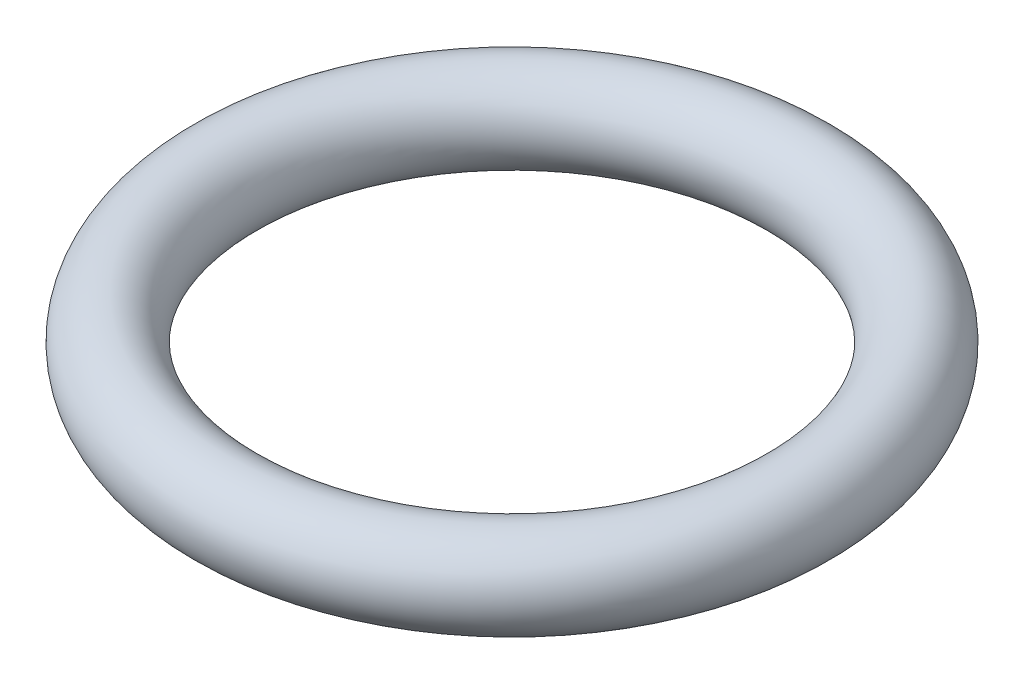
ISO-10303-21;
HEADER;
FILE_DESCRIPTION(('STEP AP214'),'2;1');
FILE_NAME('part.step','',(''),(''),'','','');
FILE_SCHEMA(('AUTOMOTIVE_DESIGN { 1 0 10303 214 1 1 1 1 }'));
ENDSEC;
DATA;
#1=APPLICATION_CONTEXT('core data for automotive mechanical design processes');
#2=APPLICATION_PROTOCOL_DEFINITION('international standard','automotive_design',2000,#1);
#3=PRODUCT_CONTEXT('',#1,'mechanical');
#4=PRODUCT('Part','Part','',(#3));
#5=PRODUCT_RELATED_PRODUCT_CATEGORY('part','',(#4));
#6=PRODUCT_DEFINITION_FORMATION('','',#4);
#7=PRODUCT_DEFINITION_CONTEXT('part definition',#1,'design');
#8=PRODUCT_DEFINITION('design','',#6,#7);
#9=PRODUCT_DEFINITION_SHAPE('','',#8);
#10=(LENGTH_UNIT() NAMED_UNIT(*) SI_UNIT(.MILLI.,.METRE.));
#11=(NAMED_UNIT(*) PLANE_ANGLE_UNIT() SI_UNIT($,.RADIAN.));
#12=(NAMED_UNIT(*) SI_UNIT($,.STERADIAN.) SOLID_ANGLE_UNIT());
#13=UNCERTAINTY_MEASURE_WITH_UNIT(LENGTH_MEASURE(1.E-05),#10,'distance_accuracy_value','');
#14=(GEOMETRIC_REPRESENTATION_CONTEXT(3) GLOBAL_UNCERTAINTY_ASSIGNED_CONTEXT((#13)) GLOBAL_UNIT_ASSIGNED_CONTEXT((#10,
#11,#12)) REPRESENTATION_CONTEXT('',''));
#15=CARTESIAN_POINT('',(0.,0.,0.));
#16=DIRECTION('',(0.,0.,1.));
#17=DIRECTION('',(1.,0.,0.));
#18=AXIS2_PLACEMENT_3D('',#15,#16,#17);
#19=CARTESIAN_POINT('',(0.,0.,0.));
#20=DIRECTION('',(0.,-1.,0.));
#21=DIRECTION('',(0.,0.,-1.));
#22=AXIS2_PLACEMENT_3D('',#19,#20,#21);
#23=TOROIDAL_SURFACE('',#22,5.9,0.899999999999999);
#24=CARTESIAN_POINT('',(0.,0.,-6.8));
#25=VERTEX_POINT('',#24);
#26=VERTEX_LOOP('',#25);
#27=FACE_BOUND('',#26,.T.);
#28=ADVANCED_FACE('F29',(#27),#23,.T.);
#29=CLOSED_SHELL('',(#28));
#30=MANIFOLD_SOLID_BREP('B2',#29);
#31=ADVANCED_BREP_SHAPE_REPRESENTATION('',(#18,#30),#14);
#32=SHAPE_DEFINITION_REPRESENTATION(#9,#31);
ENDSEC;
END-ISO-10303-21;
